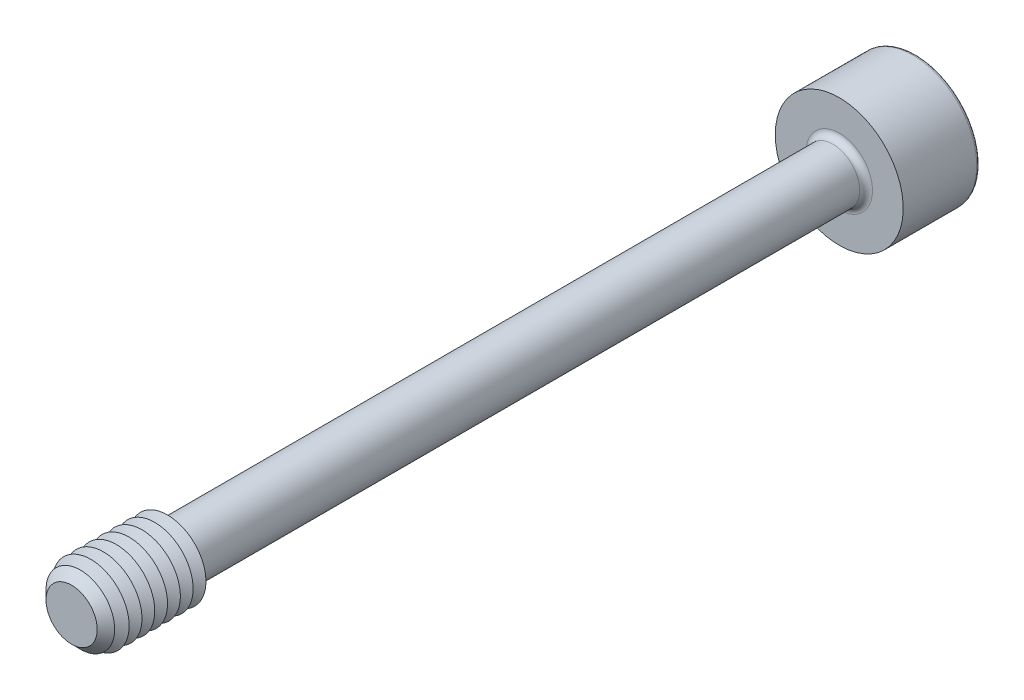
from build123d import *

# Parameters (mm, degrees)
SKETCH1_R       = 2.1
EXTRUDE1_DEPTH  = 30
CHAMFER1_SIZE   = 1
SKETCH3_R       = 5
EXTRUDE2_DEPTH  = 6
EXTRUDE3_DEPTH  = 5
FILLET1_R       = 0.5
FILLET2_R       = 0.25
LPATTERN1_COUNT = 7
LPATTERN1_PITCH = 1


with BuildPart() as part:
    # Sketch1 → Extrude1 (new, symmetric)
    with BuildSketch(Plane.XY):
        Circle(SKETCH1_R)
    extrude(amount=EXTRUDE1_DEPTH, both=True)

    # Sketch2 → Revolve1 (revolve)
    with BuildSketch(Plane(origin=(0, 0, 0), x_dir=(0, 0, -1), z_dir=(1, 0, 0))):
        Polygon((-30, 0), (-30, 3), (-22.5, 3), (-21.980384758, 2.1), (-21.980384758, 0), align=None)
    revolve(axis=Axis((0, 0, 21.980384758), (0, 0, 1)))

    # Chamfer1
    chamfer1_edges = [part.edges().sort_by_distance(p)[0] for p in [
        (0, -3, 30),
    ]]
    chamfer(chamfer1_edges, length=CHAMFER1_SIZE)

    # Sketch3 → Extrude2 (add)
    with BuildSketch(Plane(origin=(0, 0, -30), x_dir=(-1, 0, 0), z_dir=(0, 0, -1))):
        Circle(SKETCH3_R)
    extrude(amount=EXTRUDE2_DEPTH)

    # Sketch4 → Extrude3 (cut)
    with BuildSketch(Plane(origin=(-13.7, 0, -36), x_dir=(1, 0, 0), z_dir=(0, 0, 1))):
        Polygon((12.256624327, -2.5), (15.143375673, -2.5), (16.586751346, 0), (15.143375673, 2.5), (12.256624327, 2.5), (10.813248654, 0), align=None)
    extrude(amount=EXTRUDE3_DEPTH, mode=Mode.SUBTRACT)

    # Fillet1
    fillet1_edges = [part.edges().sort_by_distance(p)[0] for p in [
        (-2.1, 0, -30),
    ]]
    fillet(fillet1_edges, radius=FILLET1_R)

    # Fillet2
    fillet2_edges = [part.edges().sort_by_distance(p)[0] for p in [
        (5, 0, -36),
    ]]
    fillet(fillet2_edges, radius=FILLET2_R)

    # Sketch5 → Cut-Revolve1 (revolve, cut)
    with BuildSketch(Plane(origin=(0, 0, 0), x_dir=(0, 0, -1), z_dir=(1, 0, 0)), mode=Mode.PRIVATE) as cut_revolve1_sk:
        Polygon((31, 0), (31, -2.5), (29.556624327, 0), align=None)
    revolve(cut_revolve1_sk.sketch.rotate(Axis((0, 0, -29.556624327), (0, 0, -1)), 90), axis=Axis((0, 0, -29.556624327), (0, 0, -1)), mode=Mode.SUBTRACT)

    # Sketch7 → Cut-Revolve2 (revolve, cut)
    with BuildSketch(Plane(origin=(0, 0, 0), x_dir=(0, 0, -1), z_dir=(1, 0, 0)), mode=Mode.PRIVATE) as cut_revolve2_sk:
        Polygon((-22.5, 3), (-23, 2.133974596), (-23.5, 3), align=None)
    cut_revolve2 = revolve(cut_revolve2_sk.sketch.rotate(Axis((0, 0, -1.332048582), (0, 0, 1)), 90), axis=Axis((0, 0, -1.332048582), (0, 0, 1)), mode=Mode.SUBTRACT)

    # LPattern1: Cut-Revolve2 ×7
    with Locations(*[(0, 0, i * LPATTERN1_PITCH) for i in range(1, LPATTERN1_COUNT)]):
        add(cut_revolve2, mode=Mode.SUBTRACT)


solid = part.part
